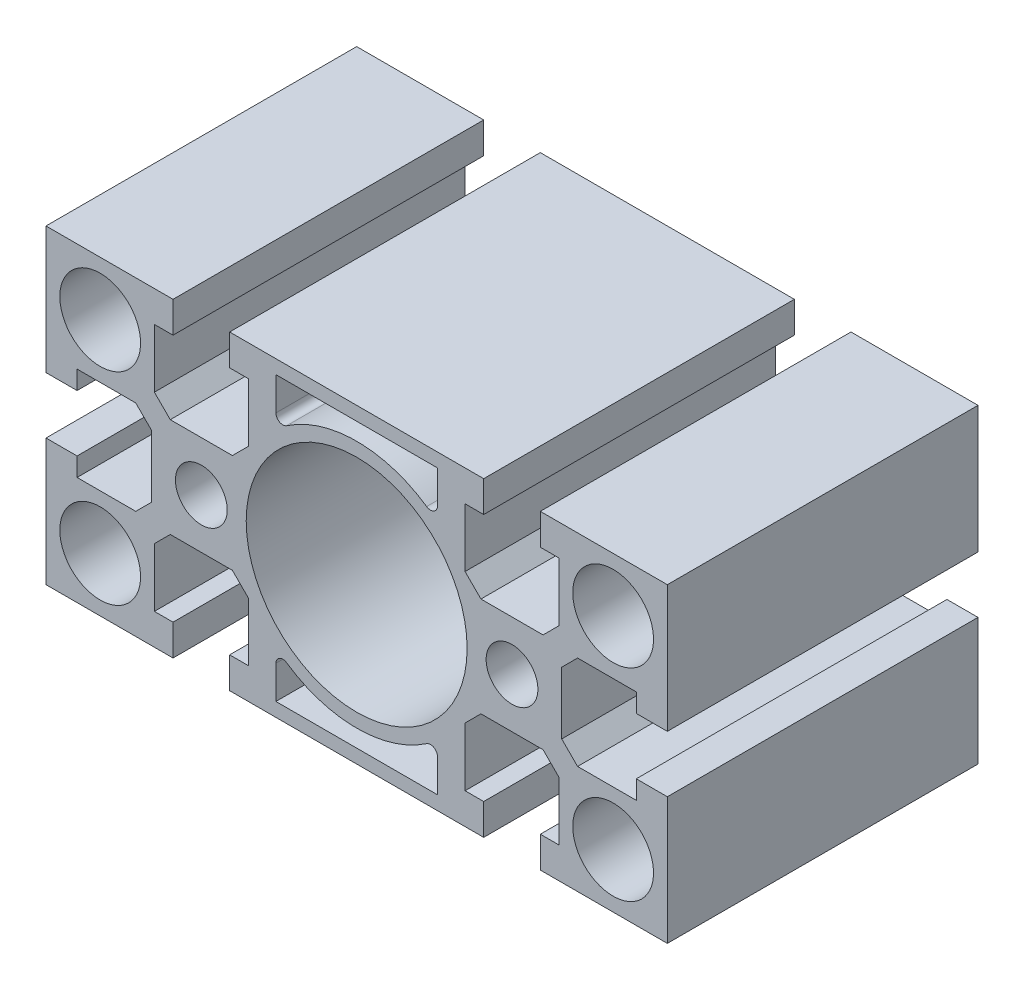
from build123d import *

# Parameters (mm, degrees)
SKETCH1_R                      = 5.85
SKETCH1_R_2                    = 16
SKETCH1_R_3                    = 3.75
EXTRUDE1_DEPTH                 = 45
F_15_0_15_DIAMETER_HOLE1_D     = 8.2
F_15_0_15_DIAMETER_HOLE1_DEPTH = 38.1
F_15_0_15_DIAMETER_HOLE1_TIP   = 2.463528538


with BuildPart() as part:
    # Sketch1 → Extrude1 (new body)
    with BuildSketch(Plane.XY):
        Polygon((40.5, 6.8), (40.5, 4.1), (45, 4.1), (45, 22.5), (26.6, 22.5), (26.6, 18), (29.3, 18), (29.3, 9.5), (27, 7.2), (18, 7.2), (15.7, 9.5), (15.7, 18), (18.4, 18), (18.4, 22.5), (-18.4, 22.5), (-18.4, 18), (-15.7, 18), (-15.7, 9.5), (-18, 7.2), (-27, 7.2), (-29.3, 9.5), (-29.3, 18), (-26.6, 18), (-26.6, 22.5), (-45, 22.5), (-45, 4.1), (-40.5, 4.1), (-40.5, 6.8), (-32, 6.8), (-29.7, 4.5), (-29.7, -4.5), (-32, -6.8), (-40.5, -6.8), (-40.5, -4.1), (-45, -4.1), (-45, -22.5), (-26.6, -22.5), (-26.6, -18), (-29.3, -18), (-29.3, -9.5), (-27, -7.2), (-18, -7.2), (-15.7, -9.5), (-15.7, -18), (-18.4, -18), (-18.4, -22.5), (18.4, -22.5), (18.4, -18), (15.7, -18), (15.7, -9.5), (18, -7.2), (27, -7.2), (29.3, -9.5), (29.3, -18), (26.6, -18), (26.6, -22.5), (45, -22.5), (45, -4.1), (40.5, -4.1), (40.5, -6.8), (32, -6.8), (29.7, -4.5), (29.7, 4.5), (32, 6.8), align=None)
        with Locations(Location((37.15, 14.65, 0), (0, 0, 180))):
            Circle(SKETCH1_R, mode=Mode.SUBTRACT)
        with Locations(Location((37.15, -14.65, 0), (0, 0, 180))):
            Circle(SKETCH1_R, mode=Mode.SUBTRACT)
        with Locations(Location((-37.15, -14.65, 0), (0, 0, 180))):
            Circle(SKETCH1_R, mode=Mode.SUBTRACT)
        with Locations(Location((-37.15, 14.65, 0), (0, 0, 180))):
            Circle(SKETCH1_R, mode=Mode.SUBTRACT)
        with Locations(Location((0, 0, 0), (0, 0, 180))):
            Circle(SKETCH1_R_2, mode=Mode.SUBTRACT)
        with Locations(Location((-22.5, 0, 0), (0, 0, 180))):
            Circle(SKETCH1_R_3, mode=Mode.SUBTRACT)
        with Locations(Location((22.5, 0, 0), (0, 0, 180))):
            Circle(SKETCH1_R_3, mode=Mode.SUBTRACT)
        with BuildLine():
            Line((11.7, 20.5), (11.7, 15.70063693))
            ThreePointArc((11.7, 15.70063693), (11.167355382, 14.816567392), (10.136842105, 14.874287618))
            ThreePointArc((10.136842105, 14.874287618), (0, 18), (-10.136842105, 14.874287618))
            ThreePointArc((-10.136842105, 14.874287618), (-11.167355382, 14.816567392), (-11.7, 15.70063693))
            Line((-11.7, 15.70063693), (-11.7, 20.5))
            Line((-11.7, 20.5), (11.7, 20.5))
        make_face(mode=Mode.SUBTRACT)
        with BuildLine():
            Line((11.7, -15.70063693), (11.7, -20.5))
            Line((11.7, -20.5), (-11.7, -20.5))
            Line((-11.7, -20.5), (-11.7, -15.70063693))
            ThreePointArc((-11.7, -15.70063693), (-11.167355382, -14.816567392), (-10.136842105, -14.874287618))
            ThreePointArc((-10.136842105, -14.874287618), (0, -18), (10.136842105, -14.874287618))
            ThreePointArc((10.136842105, -14.874287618), (11.167355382, -14.816567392), (11.7, -15.70063693))
        make_face(mode=Mode.SUBTRACT)
    extrude(amount=EXTRUDE1_DEPTH)

    # 15.0 _15_ Diameter Hole1
    with Locations(Plane(origin=(45, 0, 22.5), x_dir=(0, 1, 0), z_dir=(1, 0, 0))):
        with Locations((0, 0)):
            Hole(F_15_0_15_DIAMETER_HOLE1_D / 2, depth=F_15_0_15_DIAMETER_HOLE1_DEPTH)
            with Locations((0, 0, -(F_15_0_15_DIAMETER_HOLE1_DEPTH + F_15_0_15_DIAMETER_HOLE1_TIP / 2))):  # 118° drill point
                Cone(0, F_15_0_15_DIAMETER_HOLE1_D / 2, F_15_0_15_DIAMETER_HOLE1_TIP, mode=Mode.SUBTRACT)


solid = part.part
